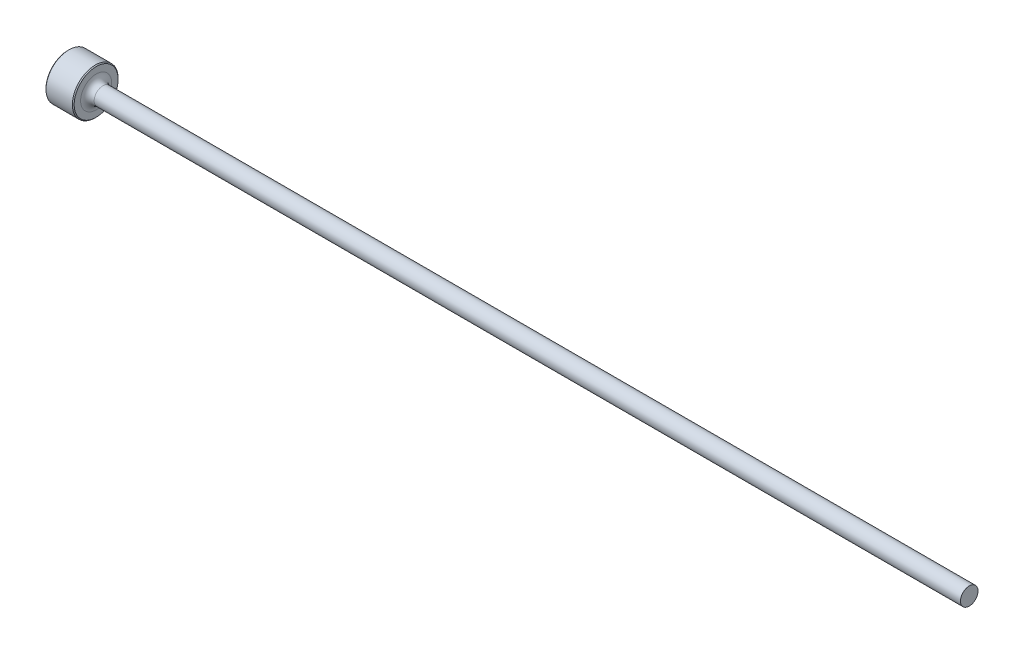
ISO-10303-21;
HEADER;
FILE_DESCRIPTION(('STEP AP214'),'2;1');
FILE_NAME('part.step','',(''),(''),'','','');
FILE_SCHEMA(('AUTOMOTIVE_DESIGN { 1 0 10303 214 1 1 1 1 }'));
ENDSEC;
DATA;
#1=APPLICATION_CONTEXT('core data for automotive mechanical design processes');
#2=APPLICATION_PROTOCOL_DEFINITION('international standard','automotive_design',2000,#1);
#3=PRODUCT_CONTEXT('',#1,'mechanical');
#4=PRODUCT('Part','Part','',(#3));
#5=PRODUCT_RELATED_PRODUCT_CATEGORY('part','',(#4));
#6=PRODUCT_DEFINITION_FORMATION('','',#4);
#7=PRODUCT_DEFINITION_CONTEXT('part definition',#1,'design');
#8=PRODUCT_DEFINITION('design','',#6,#7);
#9=PRODUCT_DEFINITION_SHAPE('','',#8);
#10=(LENGTH_UNIT() NAMED_UNIT(*) SI_UNIT(.MILLI.,.METRE.));
#11=(NAMED_UNIT(*) PLANE_ANGLE_UNIT() SI_UNIT($,.RADIAN.));
#12=(NAMED_UNIT(*) SI_UNIT($,.STERADIAN.) SOLID_ANGLE_UNIT());
#13=UNCERTAINTY_MEASURE_WITH_UNIT(LENGTH_MEASURE(1.E-05),#10,'distance_accuracy_value','');
#14=(GEOMETRIC_REPRESENTATION_CONTEXT(3) GLOBAL_UNCERTAINTY_ASSIGNED_CONTEXT((#13)) GLOBAL_UNIT_ASSIGNED_CONTEXT((#10,
#11,#12)) REPRESENTATION_CONTEXT('',''));
#15=CARTESIAN_POINT('',(0.,0.,0.));
#16=DIRECTION('',(0.,0.,1.));
#17=DIRECTION('',(1.,0.,0.));
#18=AXIS2_PLACEMENT_3D('',#15,#16,#17);
#19=CARTESIAN_POINT('',(101.6,0.988377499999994,0.));
#20=DIRECTION('',(1.,0.,0.));
#21=DIRECTION('',(0.,1.,0.));
#22=AXIS2_PLACEMENT_3D('',#19,#20,#21);
#23=PLANE('',#22);
#24=CARTESIAN_POINT('',(101.6,0.,0.));
#25=DIRECTION('',(1.,0.,0.));
#26=DIRECTION('',(0.,1.,0.));
#27=AXIS2_PLACEMENT_3D('',#24,#25,#26);
#28=CIRCLE('',#27,0.988377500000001);
#29=CARTESIAN_POINT('',(101.6,0.988377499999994,0.));
#30=VERTEX_POINT('',#29);
#31=EDGE_CURVE('E50',#30,#30,#28,.T.);
#32=ORIENTED_EDGE('',*,*,#31,.T.);
#33=EDGE_LOOP('',(#32));
#34=FACE_BOUND('',#33,.T.);
#35=ADVANCED_FACE('F30',(#34),#23,.T.);
#36=CARTESIAN_POINT('',(101.6,0.,0.));
#37=DIRECTION('',(1.,0.,0.));
#38=DIRECTION('',(0.,1.,0.));
#39=AXIS2_PLACEMENT_3D('',#36,#37,#38);
#40=CYLINDRICAL_SURFACE('',#39,0.988377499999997);
#41=CARTESIAN_POINT('',(3.937,0.,0.));
#42=DIRECTION('',(1.,0.,0.));
#43=DIRECTION('',(0.,1.,0.));
#44=AXIS2_PLACEMENT_3D('',#41,#42,#43);
#45=CIRCLE('',#44,0.988377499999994);
#46=CARTESIAN_POINT('',(3.937,0.988377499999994,0.));
#47=VERTEX_POINT('',#46);
#48=EDGE_CURVE('E53',#47,#47,#45,.T.);
#49=ORIENTED_EDGE('',*,*,#48,.T.);
#50=EDGE_LOOP('',(#49));
#51=FACE_BOUND('',#50,.T.);
#52=ORIENTED_EDGE('',*,*,#31,.F.);
#53=EDGE_LOOP('',(#52));
#54=FACE_BOUND('',#53,.T.);
#55=ADVANCED_FACE('F74',(#51,#54),#40,.T.);
#56=CARTESIAN_POINT('',(3.937,0.,0.));
#57=DIRECTION('',(1.,0.,0.));
#58=DIRECTION('',(0.,1.,0.));
#59=AXIS2_PLACEMENT_3D('',#56,#57,#58);
#60=TOROIDAL_SURFACE('',#59,1.75037749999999,0.762);
#61=CARTESIAN_POINT('',(3.175,0.,0.));
#62=DIRECTION('',(1.,0.,0.));
#63=DIRECTION('',(0.,1.,0.));
#64=AXIS2_PLACEMENT_3D('',#61,#62,#63);
#65=CIRCLE('',#64,1.75037749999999);
#66=CARTESIAN_POINT('',(3.175,1.75037749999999,0.));
#67=VERTEX_POINT('',#66);
#68=EDGE_CURVE('E56',#67,#67,#65,.T.);
#69=ORIENTED_EDGE('',*,*,#68,.T.);
#70=EDGE_LOOP('',(#69));
#71=FACE_BOUND('',#70,.T.);
#72=ORIENTED_EDGE('',*,*,#48,.F.);
#73=EDGE_LOOP('',(#72));
#74=FACE_BOUND('',#73,.T.);
#75=ADVANCED_FACE('F60',(#71,#74),#60,.F.);
#76=CARTESIAN_POINT('',(3.175,2.5796875,0.));
#77=DIRECTION('',(1.,0.,0.));
#78=DIRECTION('',(0.,1.,0.));
#79=AXIS2_PLACEMENT_3D('',#76,#77,#78);
#80=PLANE('',#79);
#81=CARTESIAN_POINT('',(3.175,0.,0.));
#82=DIRECTION('',(1.,0.,0.));
#83=DIRECTION('',(0.,1.,0.));
#84=AXIS2_PLACEMENT_3D('',#81,#82,#83);
#85=CIRCLE('',#84,2.47808749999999);
#86=CARTESIAN_POINT('',(3.175,2.47808749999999,0.));
#87=VERTEX_POINT('',#86);
#88=EDGE_CURVE('E10',#87,#87,#85,.T.);
#89=ORIENTED_EDGE('',*,*,#88,.T.);
#90=EDGE_LOOP('',(#89));
#91=FACE_BOUND('',#90,.T.);
#92=ORIENTED_EDGE('',*,*,#68,.F.);
#93=EDGE_LOOP('',(#92));
#94=FACE_BOUND('',#93,.T.);
#95=ADVANCED_FACE('F63',(#91,#94),#80,.T.);
#96=CARTESIAN_POINT('',(101.6,0.,0.));
#97=DIRECTION('',(1.,0.,0.));
#98=DIRECTION('',(0.,1.,0.));
#99=AXIS2_PLACEMENT_3D('',#96,#97,#98);
#100=CYLINDRICAL_SURFACE('',#99,2.5796875);
#101=CARTESIAN_POINT('',(0.101599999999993,0.,0.));
#102=DIRECTION('',(-1.,0.,0.));
#103=DIRECTION('',(0.,-1.,0.));
#104=AXIS2_PLACEMENT_3D('',#101,#102,#103);
#105=CIRCLE('',#104,2.5796875);
#106=CARTESIAN_POINT('',(0.101599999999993,-2.5796875,0.));
#107=VERTEX_POINT('',#106);
#108=EDGE_CURVE('E41',#107,#107,#105,.F.);
#109=ORIENTED_EDGE('',*,*,#108,.T.);
#110=EDGE_LOOP('',(#109));
#111=FACE_BOUND('',#110,.T.);
#112=CARTESIAN_POINT('',(3.07339999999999,0.,0.));
#113=DIRECTION('',(1.,0.,0.));
#114=DIRECTION('',(0.,1.,0.));
#115=AXIS2_PLACEMENT_3D('',#112,#113,#114);
#116=CIRCLE('',#115,2.5796875);
#117=CARTESIAN_POINT('',(3.07339999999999,2.5796875,0.));
#118=VERTEX_POINT('',#117);
#119=EDGE_CURVE('E45',#118,#118,#116,.F.);
#120=ORIENTED_EDGE('',*,*,#119,.T.);
#121=EDGE_LOOP('',(#120));
#122=FACE_BOUND('',#121,.T.);
#123=ADVANCED_FACE('F65',(#111,#122),#100,.T.);
#124=CARTESIAN_POINT('',(0.,0.,0.));
#125=DIRECTION('',(-1.,0.,0.));
#126=DIRECTION('',(0.,-1.,0.));
#127=AXIS2_PLACEMENT_3D('',#124,#125,#126);
#128=PLANE('',#127);
#129=CARTESIAN_POINT('',(0.,0.,0.));
#130=DIRECTION('',(-1.,0.,0.));
#131=DIRECTION('',(0.,-1.,0.));
#132=AXIS2_PLACEMENT_3D('',#129,#130,#131);
#133=CIRCLE('',#132,2.47808750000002);
#134=CARTESIAN_POINT('',(0.,-2.47808750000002,0.));
#135=VERTEX_POINT('',#134);
#136=EDGE_CURVE('E37',#135,#135,#133,.T.);
#137=ORIENTED_EDGE('',*,*,#136,.T.);
#138=EDGE_LOOP('',(#137));
#139=FACE_BOUND('',#138,.T.);
#140=ADVANCED_FACE('F71',(#139),#128,.T.);
#141=CARTESIAN_POINT('',(0.101599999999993,0.,0.));
#142=DIRECTION('',(1.,0.,0.));
#143=DIRECTION('',(0.,1.,0.));
#144=AXIS2_PLACEMENT_3D('',#141,#142,#143);
#145=CONICAL_SURFACE('',#144,2.5796875,0.785398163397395);
#146=ORIENTED_EDGE('',*,*,#136,.F.);
#147=EDGE_LOOP('',(#146));
#148=FACE_BOUND('',#147,.T.);
#149=ORIENTED_EDGE('',*,*,#108,.F.);
#150=EDGE_LOOP('',(#149));
#151=FACE_BOUND('',#150,.T.);
#152=ADVANCED_FACE('F84',(#148,#151),#145,.T.);
#153=CARTESIAN_POINT('',(3.175,0.,0.));
#154=DIRECTION('',(-1.,0.,0.));
#155=DIRECTION('',(0.,-1.,0.));
#156=AXIS2_PLACEMENT_3D('',#153,#154,#155);
#157=CONICAL_SURFACE('',#156,2.47808749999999,0.785398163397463);
#158=ORIENTED_EDGE('',*,*,#119,.F.);
#159=EDGE_LOOP('',(#158));
#160=FACE_BOUND('',#159,.T.);
#161=ORIENTED_EDGE('',*,*,#88,.F.);
#162=EDGE_LOOP('',(#161));
#163=FACE_BOUND('',#162,.T.);
#164=ADVANCED_FACE('F32',(#160,#163),#157,.T.);
#165=CLOSED_SHELL('',(#35,#55,#75,#95,#123,#140,#152,#164));
#166=MANIFOLD_SOLID_BREP('B2',#165);
#167=ADVANCED_BREP_SHAPE_REPRESENTATION('',(#18,#166),#14);
#168=SHAPE_DEFINITION_REPRESENTATION(#9,#167);
ENDSEC;
END-ISO-10303-21;
